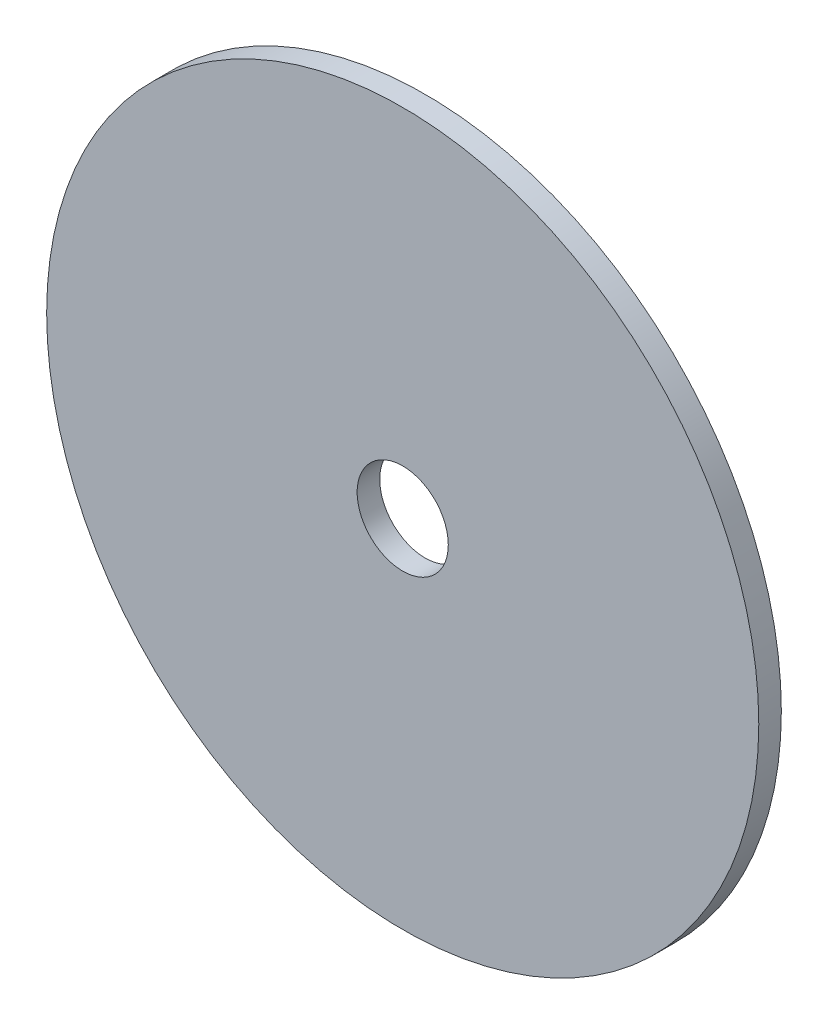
from build123d import *

# Parameters (mm, degrees)
SKETCH1_R           = 25
SKETCH1_R_2         = 3.2
BOSS_EXTRUDE1_DEPTH = 1.5841


with BuildPart() as part:
    # Sketch1 → Boss-Extrude1 (new body)
    with BuildSketch(Plane.XY):
        Circle(SKETCH1_R)
        Circle(SKETCH1_R_2, mode=Mode.SUBTRACT)
    extrude(amount=BOSS_EXTRUDE1_DEPTH)


solid = part.part
